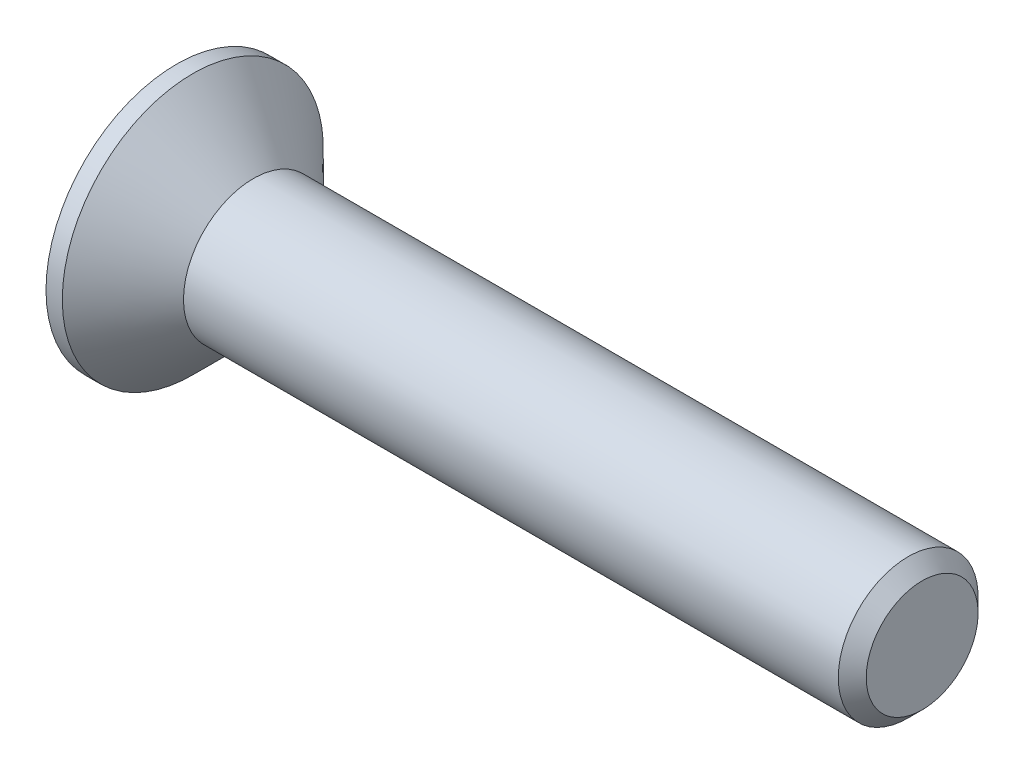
from build123d import *

# Parameters (mm, degrees)
CHAMFER1_SIZE      = 0.3
CUT_EXTRUDE1_DEPTH = 1.25


with BuildPart() as part:
    # Sketch1 → Revolve1 (revolve)
    with BuildSketch(Plane.XY, mode=Mode.PRIVATE) as revolve1_sk:
        Polygon((-1.65, 2.8), (-1.65, 0), (14.35, 0), (14.35, 1.5), (0, 1.5), (-1.3, 2.8), align=None)
    revolve(revolve1_sk.sketch.rotate(Axis((-1.65, 0, 0), (1, 0, 0)), 90), axis=Axis((-1.65, 0, 0), (1, 0, 0)))

    # Chamfer1
    chamfer1_edges = [part.edges().sort_by_distance(p)[0] for p in [
        (14.35, 0, -1.5),
    ]]
    chamfer(chamfer1_edges, length=CHAMFER1_SIZE)

    # Sketch2 → Cut-Extrude1 (cut)
    with BuildSketch(Plane.ZY.offset(1.65)):
        Polygon((-0.365, 1.45), (0.365, 1.45), (0.365, 0.365), (1.45, 0.365), (1.45, -0.365), (0.365, -0.365), (0.365, -1.45), (-0.365, -1.45), (-0.365, -0.365), (-1.45, -0.365), (-1.45, 0.365), (-0.365, 0.365), align=None)
    extrude(amount=-CUT_EXTRUDE1_DEPTH, mode=Mode.SUBTRACT)


solid = part.part
